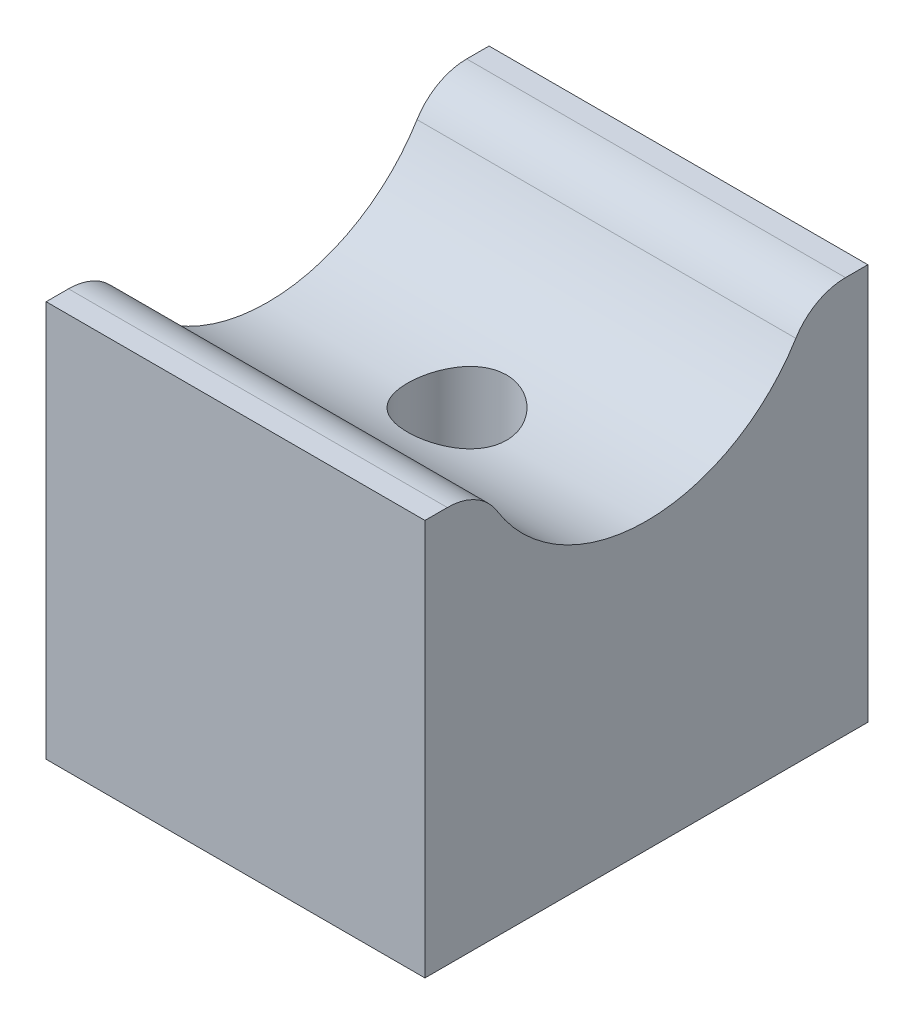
from build123d import *

# Parameters (mm, degrees)
SKIZZE2_W                                            = 32.5
SKIZZE2_H                                            = 38
GRUNDK_RPER_DEPTH                                    = 34
SCHNITT_LINEAR_AUSTRAGEN1_DEPTH                      = 43.202636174
SCHNITT_LINEAR_AUSTRAGEN1_DEPTH_BACK                 = 43.202636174
SKIZZE3_R                                            = 15.05
VERRUNDUNG1_R                                        = 5
STIRNSENKUNG_F_R_M8_ZYLINDERSCHRAUBE_MIT_D           = 8.5
STIRNSENKUNG_F_R_M8_ZYLINDERSCHRAUBE_MIT_CBORE_D     = 15.0135
STIRNSENKUNG_F_R_M8_ZYLINDERSCHRAUBE_MIT_CBORE_DEPTH = 2


with BuildPart() as part:
    # Skizze2 → Grundk_rper (new body)
    with BuildSketch(Plane(origin=(0, 0, 0), x_dir=(1, 0, 0), z_dir=(0, 1, 0))):
        Rectangle(SKIZZE2_W, SKIZZE2_H)
    extrude(amount=GRUNDK_RPER_DEPTH)

    # Skizze3 → Schnitt-Linear austragen1 (cut, two sides: drawn at the far end of the back side and taken through both)
    with BuildSketch(Plane(origin=(0, 0, 0), x_dir=(0, 0, -1), z_dir=(1, 0, 0)).offset(-SCHNITT_LINEAR_AUSTRAGEN1_DEPTH_BACK)):
        with Locations((0, 39.5)):
            Circle(SKIZZE3_R)
    extrude(amount=SCHNITT_LINEAR_AUSTRAGEN1_DEPTH + SCHNITT_LINEAR_AUSTRAGEN1_DEPTH_BACK, mode=Mode.SUBTRACT)

    # Verrundung1
    verrundung1_edges = [part.edges().sort_by_distance(p)[0] for p in [
        (0, 34, -14.009014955),
        (0, 34, 14.009014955),
    ]]
    fillet(verrundung1_edges, radius=VERRUNDUNG1_R)

    # Stirnsenkung f_r M8 Zylinderschraube mit (through all)
    with Locations(Plane.XZ):
        with Locations((0, 0)):
            CounterBoreHole(STIRNSENKUNG_F_R_M8_ZYLINDERSCHRAUBE_MIT_D / 2, STIRNSENKUNG_F_R_M8_ZYLINDERSCHRAUBE_MIT_CBORE_D / 2, STIRNSENKUNG_F_R_M8_ZYLINDERSCHRAUBE_MIT_CBORE_DEPTH)


solid = part.part
